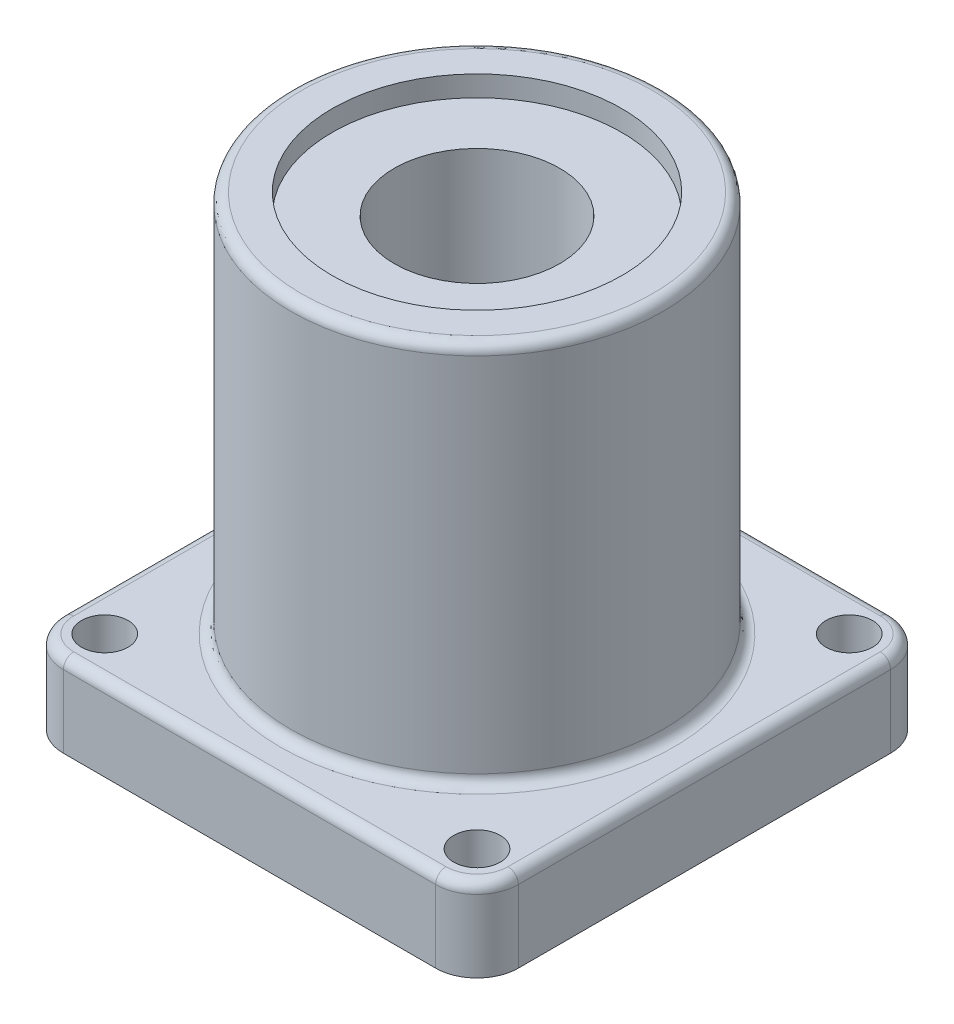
from build123d import *

# Parameters (mm, degrees)
SKETCH1_W            = 69.85
SKETCH1_H            = 69.85
BASE_EXTRUDE_DEPTH   = 12.7
SKETCH2_R            = 28.575
BOSS_EXTRUDE1_DEPTH  = 71.4375
SKETCH3_R            = 12.7
CUT_EXTRUDE1_DEPTH   = 87.849453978
SKETCH4_R            = 22.225
CUT_EXTRUDE2_DEPTH   = 3.175
FILLET1_R            = 6.35
SKETCH5_R            = 3.571875
CUT_EXTRUDE3_DEPTH   = 87.849453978
LPATTERN1_COUNT      = 2
LPATTERN1_PITCH      = 57.15
LPATTERN1_COUNT_DIR2 = 2
LPATTERN1_PITCH_DIR2 = 57.15
FILLET2_R            = 1.5875


with BuildPart() as part:
    # Sketch1 → Base-Extrude (new body)
    with BuildSketch(Plane(origin=(0, 0, 0), x_dir=(1, 0, 0), z_dir=(0, 1, 0))):
        Rectangle(SKETCH1_W, SKETCH1_H)
    extrude(amount=BASE_EXTRUDE_DEPTH)

    # Sketch2 → Boss-Extrude1 (add)
    with BuildSketch(Plane(origin=(0, 0, 0), x_dir=(-1, 0, 0), z_dir=(0, 1, 0))):
        with Locations(Location((0, 0, 0), (0, 0, 270))):
            Circle(SKETCH2_R)
    extrude(amount=BOSS_EXTRUDE1_DEPTH)

    # Sketch3 → Cut-Extrude1 (cut, through all)
    with BuildSketch(Plane(origin=(0, 71.4375, 0), x_dir=(-1, 0, 0), z_dir=(0, 1, 0))):
        with Locations(Location((0, 0, 0), (0, 0, 90))):
            Circle(SKETCH3_R)
    extrude(amount=-CUT_EXTRUDE1_DEPTH, mode=Mode.SUBTRACT)

    # Sketch4 → Cut-Extrude2 (cut)
    with BuildSketch(Plane(origin=(0, 71.4375, 0), x_dir=(-1, 0, 0), z_dir=(0, 1, 0))):
        with Locations(Location((0, 0, 0), (0, 0, 90))):
            Circle(SKETCH4_R)
    extrude(amount=-CUT_EXTRUDE2_DEPTH, mode=Mode.SUBTRACT)

    # Fillet1
    fillet1_edges = [part.edges().sort_by_distance(p)[0] for p in [
        (-34.925, 6.35, 34.925),
        (34.925, 6.35, 34.925),
        (34.925, 6.35, -34.925),
        (-34.925, 6.35, -34.925),
    ]]
    fillet(fillet1_edges, radius=FILLET1_R)

    # Sketch5 → Cut-Extrude3 (cut, through all)
    with BuildSketch(Plane.XZ):
        with Locations(Location((28.575, 28.575, 0), (0, 0, 270))):
            Circle(SKETCH5_R)
    cut_extrude3 = extrude(amount=-CUT_EXTRUDE3_DEPTH, mode=Mode.SUBTRACT)

    # LPattern1: Cut-Extrude3 2 × 2
    with Locations(*[(-j * LPATTERN1_PITCH_DIR2, 0, -i * LPATTERN1_PITCH) for i in range(LPATTERN1_COUNT) for j in range(LPATTERN1_COUNT_DIR2) if (i, j) != (0, 0)]):
        add(cut_extrude3, mode=Mode.SUBTRACT)

    # Fillet2
    fillet2_edges = [part.edges().sort_by_distance(p)[0] for p in [
        (0, 12.7, 28.575),
        (0, 71.4375, 28.575),
        (34.925, 12.7, 0),
        (0, 12.7, 34.925),
        (-34.925, 12.7, 0),
        (0, 12.7, -34.925),
        (-33.065128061, 12.7, -33.065128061),
        (-33.065128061, 12.7, 33.065128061),
        (33.065128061, 12.7, -33.065128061),
        (33.065128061, 12.7, 33.065128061),
    ]]
    fillet(fillet2_edges, radius=FILLET2_R)


solid = part.part
